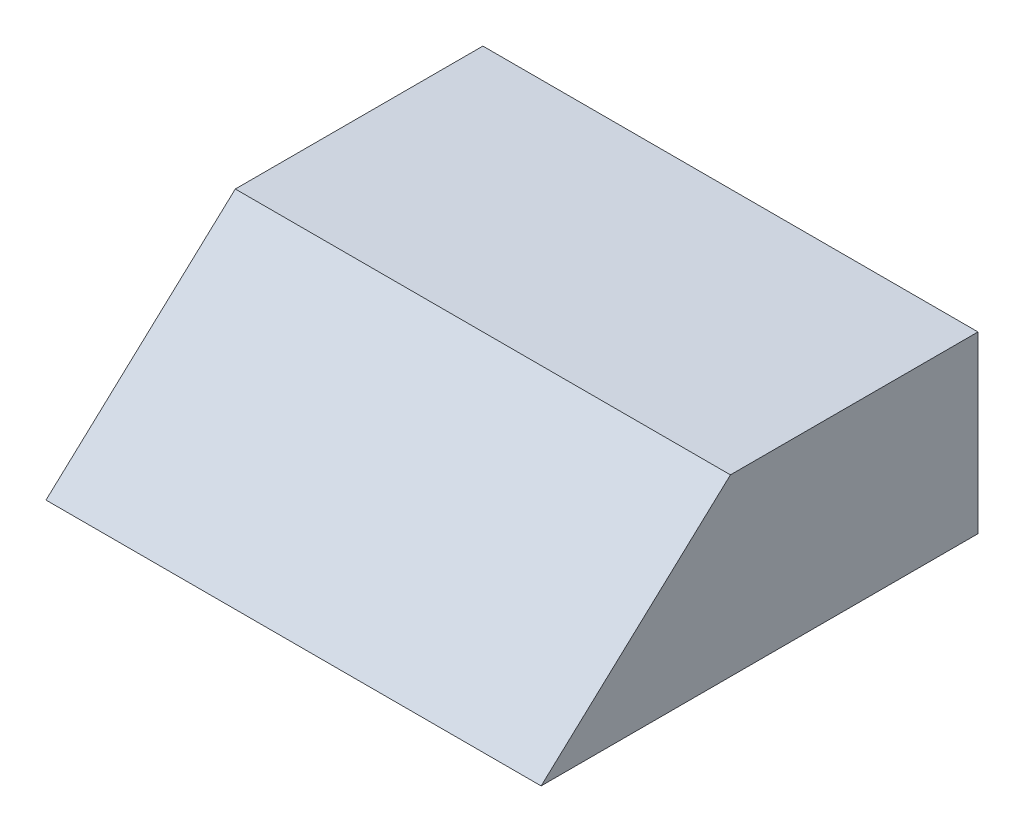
ISO-10303-21;
HEADER;
FILE_DESCRIPTION(('STEP AP214'),'2;1');
FILE_NAME('part.step','',(''),(''),'','','');
FILE_SCHEMA(('AUTOMOTIVE_DESIGN { 1 0 10303 214 1 1 1 1 }'));
ENDSEC;
DATA;
#1=APPLICATION_CONTEXT('core data for automotive mechanical design processes');
#2=APPLICATION_PROTOCOL_DEFINITION('international standard','automotive_design',2000,#1);
#3=PRODUCT_CONTEXT('',#1,'mechanical');
#4=PRODUCT('Part','Part','',(#3));
#5=PRODUCT_RELATED_PRODUCT_CATEGORY('part','',(#4));
#6=PRODUCT_DEFINITION_FORMATION('','',#4);
#7=PRODUCT_DEFINITION_CONTEXT('part definition',#1,'design');
#8=PRODUCT_DEFINITION('design','',#6,#7);
#9=PRODUCT_DEFINITION_SHAPE('','',#8);
#10=(LENGTH_UNIT() NAMED_UNIT(*) SI_UNIT(.MILLI.,.METRE.));
#11=(NAMED_UNIT(*) PLANE_ANGLE_UNIT() SI_UNIT($,.RADIAN.));
#12=(NAMED_UNIT(*) SI_UNIT($,.STERADIAN.) SOLID_ANGLE_UNIT());
#13=UNCERTAINTY_MEASURE_WITH_UNIT(LENGTH_MEASURE(1.E-05),#10,'distance_accuracy_value','');
#14=(GEOMETRIC_REPRESENTATION_CONTEXT(3) GLOBAL_UNCERTAINTY_ASSIGNED_CONTEXT((#13)) GLOBAL_UNIT_ASSIGNED_CONTEXT((#10,
#11,#12)) REPRESENTATION_CONTEXT('',''));
#15=CARTESIAN_POINT('',(0.,0.,0.));
#16=DIRECTION('',(0.,0.,1.));
#17=DIRECTION('',(1.,0.,0.));
#18=AXIS2_PLACEMENT_3D('',#15,#16,#17);
#19=CARTESIAN_POINT('',(17.,12.,-12.9999999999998));
#20=DIRECTION('',(0.,-0.734803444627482,-0.678280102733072));
#21=DIRECTION('',(0.,0.678280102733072,-0.734803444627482));
#22=AXIS2_PLACEMENT_3D('',#19,#20,#21);
#23=PLANE('',#22);
#24=DIRECTION('',(0.,-0.678280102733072,0.734803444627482));
#25=VECTOR('',#24,1.);
#26=CARTESIAN_POINT('',(-17.,12.,-12.9999999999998));
#27=LINE('',#26,#25);
#28=CARTESIAN_POINT('',(-17.,12.,-12.9999999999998));
#29=VERTEX_POINT('',#28);
#30=CARTESIAN_POINT('',(-17.,0.,0.));
#31=VERTEX_POINT('',#30);
#32=EDGE_CURVE('E66',#29,#31,#27,.T.);
#33=ORIENTED_EDGE('',*,*,#32,.T.);
#34=DIRECTION('',(-1.,0.,0.));
#35=VECTOR('',#34,1.);
#36=CARTESIAN_POINT('',(17.,0.,0.));
#37=LINE('',#36,#35);
#38=CARTESIAN_POINT('',(17.,0.,0.));
#39=VERTEX_POINT('',#38);
#40=EDGE_CURVE('E11',#39,#31,#37,.T.);
#41=ORIENTED_EDGE('',*,*,#40,.F.);
#42=DIRECTION('',(0.,-0.678280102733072,0.734803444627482));
#43=VECTOR('',#42,1.);
#44=CARTESIAN_POINT('',(17.,12.,-12.9999999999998));
#45=LINE('',#44,#43);
#46=CARTESIAN_POINT('',(17.,12.,-12.9999999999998));
#47=VERTEX_POINT('',#46);
#48=EDGE_CURVE('E84',#47,#39,#45,.T.);
#49=ORIENTED_EDGE('',*,*,#48,.F.);
#50=DIRECTION('',(-1.,0.,0.));
#51=VECTOR('',#50,1.);
#52=CARTESIAN_POINT('',(17.,12.,-12.9999999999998));
#53=LINE('',#52,#51);
#54=EDGE_CURVE('E78',#47,#29,#53,.T.);
#55=ORIENTED_EDGE('',*,*,#54,.T.);
#56=EDGE_LOOP('',(#33,#41,#49,#55));
#57=FACE_BOUND('',#56,.T.);
#58=ADVANCED_FACE('F22',(#57),#23,.F.);
#59=CARTESIAN_POINT('',(17.,0.,0.));
#60=DIRECTION('',(0.,1.,0.));
#61=DIRECTION('',(0.,0.,1.));
#62=AXIS2_PLACEMENT_3D('',#59,#60,#61);
#63=PLANE('',#62);
#64=DIRECTION('',(0.,0.,-1.));
#65=VECTOR('',#64,1.);
#66=CARTESIAN_POINT('',(-17.,0.,0.));
#67=LINE('',#66,#65);
#68=CARTESIAN_POINT('',(-17.,0.,-29.9999999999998));
#69=VERTEX_POINT('',#68);
#70=EDGE_CURVE('E62',#31,#69,#67,.T.);
#71=ORIENTED_EDGE('',*,*,#70,.T.);
#72=DIRECTION('',(-1.,0.,0.));
#73=VECTOR('',#72,1.);
#74=CARTESIAN_POINT('',(17.,0.,-29.9999999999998));
#75=LINE('',#74,#73);
#76=CARTESIAN_POINT('',(17.,0.,-29.9999999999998));
#77=VERTEX_POINT('',#76);
#78=EDGE_CURVE('E29',#77,#69,#75,.T.);
#79=ORIENTED_EDGE('',*,*,#78,.F.);
#80=DIRECTION('',(0.,0.,-1.));
#81=VECTOR('',#80,1.);
#82=CARTESIAN_POINT('',(17.,0.,0.));
#83=LINE('',#82,#81);
#84=EDGE_CURVE('E74',#39,#77,#83,.T.);
#85=ORIENTED_EDGE('',*,*,#84,.F.);
#86=ORIENTED_EDGE('',*,*,#40,.T.);
#87=EDGE_LOOP('',(#71,#79,#85,#86));
#88=FACE_BOUND('',#87,.T.);
#89=ADVANCED_FACE('F73',(#88),#63,.F.);
#90=CARTESIAN_POINT('',(17.,0.,-29.9999999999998));
#91=DIRECTION('',(0.,0.,1.));
#92=DIRECTION('',(1.,0.,0.));
#93=AXIS2_PLACEMENT_3D('',#90,#91,#92);
#94=PLANE('',#93);
#95=DIRECTION('',(0.,1.,0.));
#96=VECTOR('',#95,1.);
#97=CARTESIAN_POINT('',(-17.,0.,-29.9999999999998));
#98=LINE('',#97,#96);
#99=CARTESIAN_POINT('',(-17.,12.,-29.9999999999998));
#100=VERTEX_POINT('',#99);
#101=EDGE_CURVE('E67',#69,#100,#98,.T.);
#102=ORIENTED_EDGE('',*,*,#101,.T.);
#103=DIRECTION('',(-1.,0.,0.));
#104=VECTOR('',#103,1.);
#105=CARTESIAN_POINT('',(17.,12.,-29.9999999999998));
#106=LINE('',#105,#104);
#107=CARTESIAN_POINT('',(17.,12.,-29.9999999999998));
#108=VERTEX_POINT('',#107);
#109=EDGE_CURVE('E90',#108,#100,#106,.T.);
#110=ORIENTED_EDGE('',*,*,#109,.F.);
#111=DIRECTION('',(0.,1.,0.));
#112=VECTOR('',#111,1.);
#113=CARTESIAN_POINT('',(17.,0.,-29.9999999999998));
#114=LINE('',#113,#112);
#115=EDGE_CURVE('E41',#77,#108,#114,.T.);
#116=ORIENTED_EDGE('',*,*,#115,.F.);
#117=ORIENTED_EDGE('',*,*,#78,.T.);
#118=EDGE_LOOP('',(#102,#110,#116,#117));
#119=FACE_BOUND('',#118,.T.);
#120=ADVANCED_FACE('F93',(#119),#94,.F.);
#121=CARTESIAN_POINT('',(17.,12.,-29.9999999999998));
#122=DIRECTION('',(0.,-1.,0.));
#123=DIRECTION('',(0.,0.,-1.));
#124=AXIS2_PLACEMENT_3D('',#121,#122,#123);
#125=PLANE('',#124);
#126=DIRECTION('',(0.,0.,1.));
#127=VECTOR('',#126,1.);
#128=CARTESIAN_POINT('',(-17.,12.,-29.9999999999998));
#129=LINE('',#128,#127);
#130=EDGE_CURVE('E82',#100,#29,#129,.T.);
#131=ORIENTED_EDGE('',*,*,#130,.T.);
#132=ORIENTED_EDGE('',*,*,#54,.F.);
#133=DIRECTION('',(0.,0.,1.));
#134=VECTOR('',#133,1.);
#135=CARTESIAN_POINT('',(17.,12.,-29.9999999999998));
#136=LINE('',#135,#134);
#137=EDGE_CURVE('E36',#108,#47,#136,.T.);
#138=ORIENTED_EDGE('',*,*,#137,.F.);
#139=ORIENTED_EDGE('',*,*,#109,.T.);
#140=EDGE_LOOP('',(#131,#132,#138,#139));
#141=FACE_BOUND('',#140,.T.);
#142=ADVANCED_FACE('F95',(#141),#125,.F.);
#143=CARTESIAN_POINT('',(17.,27.692307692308,-29.9999999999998));
#144=DIRECTION('',(-1.,0.,0.));
#145=DIRECTION('',(0.,0.,1.));
#146=AXIS2_PLACEMENT_3D('',#143,#144,#145);
#147=PLANE('',#146);
#148=ORIENTED_EDGE('',*,*,#48,.T.);
#149=ORIENTED_EDGE('',*,*,#84,.T.);
#150=ORIENTED_EDGE('',*,*,#115,.T.);
#151=ORIENTED_EDGE('',*,*,#137,.T.);
#152=EDGE_LOOP('',(#148,#149,#150,#151));
#153=FACE_BOUND('',#152,.T.);
#154=ADVANCED_FACE('F96',(#153),#147,.F.);
#155=CARTESIAN_POINT('',(-17.,27.692307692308,-29.9999999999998));
#156=DIRECTION('',(-1.,0.,0.));
#157=DIRECTION('',(0.,0.,1.));
#158=AXIS2_PLACEMENT_3D('',#155,#156,#157);
#159=PLANE('',#158);
#160=ORIENTED_EDGE('',*,*,#32,.F.);
#161=ORIENTED_EDGE('',*,*,#130,.F.);
#162=ORIENTED_EDGE('',*,*,#101,.F.);
#163=ORIENTED_EDGE('',*,*,#70,.F.);
#164=EDGE_LOOP('',(#160,#161,#162,#163));
#165=FACE_BOUND('',#164,.T.);
#166=ADVANCED_FACE('F63',(#165),#159,.T.);
#167=CLOSED_SHELL('',(#58,#89,#120,#142,#154,#166));
#168=MANIFOLD_SOLID_BREP('B2',#167);
#169=ADVANCED_BREP_SHAPE_REPRESENTATION('',(#18,#168),#14);
#170=SHAPE_DEFINITION_REPRESENTATION(#9,#169);
ENDSEC;
END-ISO-10303-21;
